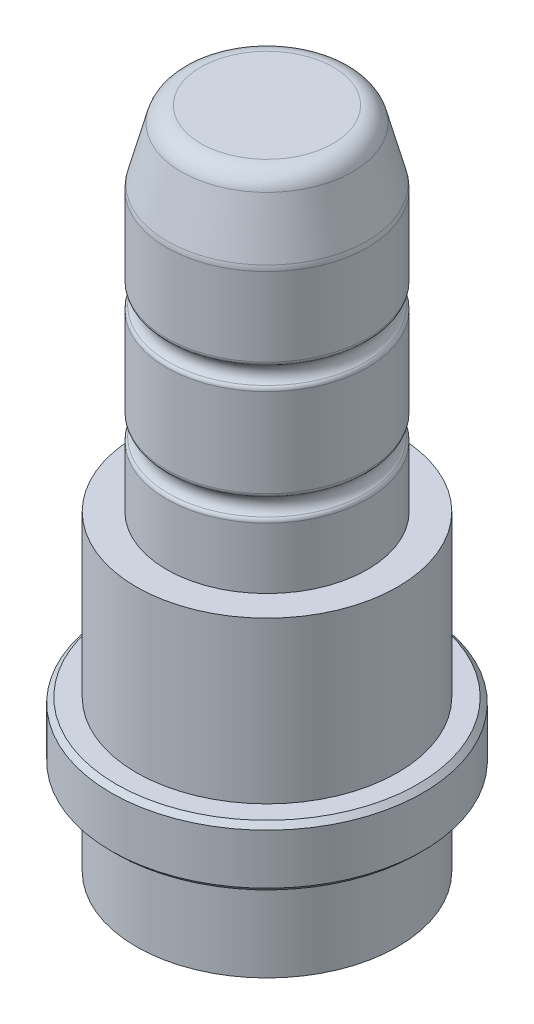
ISO-10303-21;
HEADER;
FILE_DESCRIPTION(('STEP AP214'),'2;1');
FILE_NAME('part.step','',(''),(''),'','','');
FILE_SCHEMA(('AUTOMOTIVE_DESIGN { 1 0 10303 214 1 1 1 1 }'));
ENDSEC;
DATA;
#1=APPLICATION_CONTEXT('core data for automotive mechanical design processes');
#2=APPLICATION_PROTOCOL_DEFINITION('international standard','automotive_design',2000,#1);
#3=PRODUCT_CONTEXT('',#1,'mechanical');
#4=PRODUCT('Part','Part','',(#3));
#5=PRODUCT_RELATED_PRODUCT_CATEGORY('part','',(#4));
#6=PRODUCT_DEFINITION_FORMATION('','',#4);
#7=PRODUCT_DEFINITION_CONTEXT('part definition',#1,'design');
#8=PRODUCT_DEFINITION('design','',#6,#7);
#9=PRODUCT_DEFINITION_SHAPE('','',#8);
#10=(LENGTH_UNIT() NAMED_UNIT(*) SI_UNIT(.MILLI.,.METRE.));
#11=(NAMED_UNIT(*) PLANE_ANGLE_UNIT() SI_UNIT($,.RADIAN.));
#12=(NAMED_UNIT(*) SI_UNIT($,.STERADIAN.) SOLID_ANGLE_UNIT());
#13=UNCERTAINTY_MEASURE_WITH_UNIT(LENGTH_MEASURE(1.E-05),#10,'distance_accuracy_value','');
#14=(GEOMETRIC_REPRESENTATION_CONTEXT(3) GLOBAL_UNCERTAINTY_ASSIGNED_CONTEXT((#13)) GLOBAL_UNIT_ASSIGNED_CONTEXT((#10,
#11,#12)) REPRESENTATION_CONTEXT('',''));
#15=CARTESIAN_POINT('',(0.,0.,0.));
#16=DIRECTION('',(0.,0.,1.));
#17=DIRECTION('',(1.,0.,0.));
#18=AXIS2_PLACEMENT_3D('',#15,#16,#17);
#19=CARTESIAN_POINT('',(0.,6.,0.));
#20=DIRECTION('',(0.,-1.,0.));
#21=DIRECTION('',(0.,0.,-1.));
#22=AXIS2_PLACEMENT_3D('',#19,#20,#21);
#23=CYLINDRICAL_SURFACE('',#22,15.5);
#24=CARTESIAN_POINT('',(0.,5.5,0.));
#25=DIRECTION('',(0.,1.,0.));
#26=DIRECTION('',(0.,0.,1.));
#27=AXIS2_PLACEMENT_3D('',#24,#25,#26);
#28=CIRCLE('',#27,15.5);
#29=CARTESIAN_POINT('',(0.,5.5,15.5));
#30=VERTEX_POINT('',#29);
#31=EDGE_CURVE('E22',#30,#30,#28,.F.);
#32=ORIENTED_EDGE('',*,*,#31,.T.);
#33=EDGE_LOOP('',(#32));
#34=FACE_BOUND('',#33,.T.);
#35=CARTESIAN_POINT('',(0.,0.5,0.));
#36=DIRECTION('',(0.,1.,0.));
#37=DIRECTION('',(0.,0.,1.));
#38=AXIS2_PLACEMENT_3D('',#35,#36,#37);
#39=CIRCLE('',#38,15.5);
#40=CARTESIAN_POINT('',(0.,0.5,15.5));
#41=VERTEX_POINT('',#40);
#42=EDGE_CURVE('E30',#41,#41,#39,.T.);
#43=ORIENTED_EDGE('',*,*,#42,.T.);
#44=EDGE_LOOP('',(#43));
#45=FACE_BOUND('',#44,.T.);
#46=ADVANCED_FACE('F14',(#34,#45),#23,.T.);
#47=CARTESIAN_POINT('',(0.,6.,0.));
#48=DIRECTION('',(0.,1.,0.));
#49=DIRECTION('',(0.,0.,1.));
#50=AXIS2_PLACEMENT_3D('',#47,#48,#49);
#51=PLANE('',#50);
#52=CARTESIAN_POINT('',(0.,6.,0.));
#53=DIRECTION('',(0.,1.,0.));
#54=DIRECTION('',(0.,0.,1.));
#55=AXIS2_PLACEMENT_3D('',#52,#53,#54);
#56=CIRCLE('',#55,15.);
#57=CARTESIAN_POINT('',(0.,6.,15.));
#58=VERTEX_POINT('',#57);
#59=EDGE_CURVE('E36',#58,#58,#56,.T.);
#60=ORIENTED_EDGE('',*,*,#59,.T.);
#61=EDGE_LOOP('',(#60));
#62=FACE_BOUND('',#61,.T.);
#63=CARTESIAN_POINT('',(0.,6.,0.));
#64=DIRECTION('',(0.,-1.,0.));
#65=DIRECTION('',(0.,0.,-1.));
#66=AXIS2_PLACEMENT_3D('',#63,#64,#65);
#67=CIRCLE('',#66,13.);
#68=CARTESIAN_POINT('',(0.,5.99999999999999,-13.));
#69=VERTEX_POINT('',#68);
#70=EDGE_CURVE('E47',#69,#69,#67,.T.);
#71=ORIENTED_EDGE('',*,*,#70,.T.);
#72=EDGE_LOOP('',(#71));
#73=FACE_BOUND('',#72,.T.);
#74=ADVANCED_FACE('F125',(#62,#73),#51,.T.);
#75=CARTESIAN_POINT('',(0.,0.,0.));
#76=DIRECTION('',(0.,1.,0.));
#77=DIRECTION('',(0.,0.,1.));
#78=AXIS2_PLACEMENT_3D('',#75,#76,#77);
#79=PLANE('',#78);
#80=CARTESIAN_POINT('',(0.,0.,0.));
#81=DIRECTION('',(0.,1.,0.));
#82=DIRECTION('',(0.,0.,1.));
#83=AXIS2_PLACEMENT_3D('',#80,#81,#82);
#84=CIRCLE('',#83,15.);
#85=CARTESIAN_POINT('',(0.,0.,15.));
#86=VERTEX_POINT('',#85);
#87=EDGE_CURVE('E9',#86,#86,#84,.F.);
#88=ORIENTED_EDGE('',*,*,#87,.T.);
#89=EDGE_LOOP('',(#88));
#90=FACE_BOUND('',#89,.T.);
#91=CARTESIAN_POINT('',(0.,0.,0.));
#92=DIRECTION('',(0.,1.,0.));
#93=DIRECTION('',(0.,0.,1.));
#94=AXIS2_PLACEMENT_3D('',#91,#92,#93);
#95=CIRCLE('',#94,13.);
#96=CARTESIAN_POINT('',(0.,0.,13.));
#97=VERTEX_POINT('',#96);
#98=EDGE_CURVE('E103',#97,#97,#95,.T.);
#99=ORIENTED_EDGE('',*,*,#98,.T.);
#100=EDGE_LOOP('',(#99));
#101=FACE_BOUND('',#100,.T.);
#102=ADVANCED_FACE('F108',(#90,#101),#79,.F.);
#103=CARTESIAN_POINT('',(0.,22.,0.));
#104=DIRECTION('',(0.,-1.,0.));
#105=DIRECTION('',(0.,0.,-1.));
#106=AXIS2_PLACEMENT_3D('',#103,#104,#105);
#107=PLANE('',#106);
#108=CARTESIAN_POINT('',(0.,22.,0.));
#109=DIRECTION('',(0.,1.,0.));
#110=DIRECTION('',(0.,0.,1.));
#111=AXIS2_PLACEMENT_3D('',#108,#109,#110);
#112=CIRCLE('',#111,10.);
#113=CARTESIAN_POINT('',(0.,22.,9.99999999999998));
#114=VERTEX_POINT('',#113);
#115=EDGE_CURVE('E42',#114,#114,#112,.T.);
#116=ORIENTED_EDGE('',*,*,#115,.F.);
#117=EDGE_LOOP('',(#116));
#118=FACE_BOUND('',#117,.T.);
#119=CARTESIAN_POINT('',(0.,22.,0.));
#120=DIRECTION('',(0.,-1.,0.));
#121=DIRECTION('',(0.,0.,-1.));
#122=AXIS2_PLACEMENT_3D('',#119,#120,#121);
#123=CIRCLE('',#122,13.);
#124=CARTESIAN_POINT('',(0.,22.,-13.));
#125=VERTEX_POINT('',#124);
#126=EDGE_CURVE('E43',#125,#125,#123,.T.);
#127=ORIENTED_EDGE('',*,*,#126,.F.);
#128=EDGE_LOOP('',(#127));
#129=FACE_BOUND('',#128,.T.);
#130=ADVANCED_FACE('F134',(#118,#129),#107,.F.);
#131=CARTESIAN_POINT('',(0.,6.,0.));
#132=DIRECTION('',(0.,-1.,0.));
#133=DIRECTION('',(0.,0.,-1.));
#134=AXIS2_PLACEMENT_3D('',#131,#132,#133);
#135=CYLINDRICAL_SURFACE('',#134,13.);
#136=ORIENTED_EDGE('',*,*,#70,.F.);
#137=EDGE_LOOP('',(#136));
#138=FACE_BOUND('',#137,.T.);
#139=ORIENTED_EDGE('',*,*,#126,.T.);
#140=EDGE_LOOP('',(#139));
#141=FACE_BOUND('',#140,.T.);
#142=ADVANCED_FACE('F138',(#138,#141),#135,.T.);
#143=CARTESIAN_POINT('',(0.,57.,0.));
#144=DIRECTION('',(0.,1.,0.));
#145=DIRECTION('',(0.,0.,1.));
#146=AXIS2_PLACEMENT_3D('',#143,#144,#145);
#147=PLANE('',#146);
#148=CARTESIAN_POINT('',(0.,57.,0.));
#149=DIRECTION('',(0.,1.,0.));
#150=DIRECTION('',(0.,0.,1.));
#151=AXIS2_PLACEMENT_3D('',#148,#149,#150);
#152=CIRCLE('',#151,6.58970167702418);
#153=CARTESIAN_POINT('',(0.,57.,6.58970167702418));
#154=VERTEX_POINT('',#153);
#155=EDGE_CURVE('E51',#154,#154,#152,.T.);
#156=ORIENTED_EDGE('',*,*,#155,.T.);
#157=EDGE_LOOP('',(#156));
#158=FACE_BOUND('',#157,.T.);
#159=ADVANCED_FACE('F142',(#158),#147,.T.);
#160=CARTESIAN_POINT('',(0.,55.,0.));
#161=DIRECTION('',(0.,1.,0.));
#162=DIRECTION('',(0.,0.,1.));
#163=AXIS2_PLACEMENT_3D('',#160,#161,#162);
#164=TOROIDAL_SURFACE('',#163,6.58970167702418,2.);
#165=CARTESIAN_POINT('',(0.,55.5176380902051,0.));
#166=DIRECTION('',(0.,1.,0.));
#167=DIRECTION('',(0.,0.,1.));
#168=AXIS2_PLACEMENT_3D('',#165,#166,#167);
#169=CIRCLE('',#168,8.52155332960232);
#170=CARTESIAN_POINT('',(0.,55.5176380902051,8.52155332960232));
#171=VERTEX_POINT('',#170);
#172=EDGE_CURVE('E54',#171,#171,#169,.T.);
#173=ORIENTED_EDGE('',*,*,#172,.T.);
#174=EDGE_LOOP('',(#173));
#175=FACE_BOUND('',#174,.T.);
#176=ORIENTED_EDGE('',*,*,#155,.F.);
#177=EDGE_LOOP('',(#176));
#178=FACE_BOUND('',#177,.T.);
#179=ADVANCED_FACE('F146',(#175,#178),#164,.T.);
#180=CARTESIAN_POINT('',(0.,55.5176380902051,0.));
#181=DIRECTION('',(0.,-1.,0.));
#182=DIRECTION('',(0.,0.,-1.));
#183=AXIS2_PLACEMENT_3D('',#180,#181,#182);
#184=CONICAL_SURFACE('',#183,8.52155332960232,0.261799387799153);
#185=CARTESIAN_POINT('',(0.,50.2543330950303,0.));
#186=DIRECTION('',(0.,1.,0.));
#187=DIRECTION('',(0.,0.,1.));
#188=AXIS2_PLACEMENT_3D('',#185,#186,#187);
#189=CIRCLE('',#188,9.93185165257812);
#190=CARTESIAN_POINT('',(0.,50.2543330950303,9.93185165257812));
#191=VERTEX_POINT('',#190);
#192=EDGE_CURVE('E58',#191,#191,#189,.T.);
#193=ORIENTED_EDGE('',*,*,#192,.T.);
#194=EDGE_LOOP('',(#193));
#195=FACE_BOUND('',#194,.T.);
#196=ORIENTED_EDGE('',*,*,#172,.F.);
#197=EDGE_LOOP('',(#196));
#198=FACE_BOUND('',#197,.T.);
#199=ADVANCED_FACE('F150',(#195,#198),#184,.T.);
#200=CARTESIAN_POINT('',(0.,49.7366950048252,0.));
#201=DIRECTION('',(0.,1.,0.));
#202=DIRECTION('',(0.,0.,1.));
#203=AXIS2_PLACEMENT_3D('',#200,#201,#202);
#204=TOROIDAL_SURFACE('',#203,8.,2.);
#205=CARTESIAN_POINT('',(0.,49.7366950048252,0.));
#206=DIRECTION('',(0.,1.,0.));
#207=DIRECTION('',(0.,0.,1.));
#208=AXIS2_PLACEMENT_3D('',#205,#206,#207);
#209=CIRCLE('',#208,10.);
#210=CARTESIAN_POINT('',(0.,49.7366950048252,10.));
#211=VERTEX_POINT('',#210);
#212=EDGE_CURVE('E62',#211,#211,#209,.T.);
#213=ORIENTED_EDGE('',*,*,#212,.T.);
#214=EDGE_LOOP('',(#213));
#215=FACE_BOUND('',#214,.T.);
#216=ORIENTED_EDGE('',*,*,#192,.F.);
#217=EDGE_LOOP('',(#216));
#218=FACE_BOUND('',#217,.T.);
#219=ADVANCED_FACE('F154',(#215,#218),#204,.T.);
#220=CARTESIAN_POINT('',(0.,57.,0.));
#221=DIRECTION('',(0.,1.,0.));
#222=DIRECTION('',(0.,0.,1.));
#223=AXIS2_PLACEMENT_3D('',#220,#221,#222);
#224=CYLINDRICAL_SURFACE('',#223,10.);
#225=CARTESIAN_POINT('',(0.,41.9386863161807,0.));
#226=DIRECTION('',(0.,1.,0.));
#227=DIRECTION('',(0.,0.,1.));
#228=AXIS2_PLACEMENT_3D('',#225,#226,#227);
#229=CIRCLE('',#228,10.);
#230=CARTESIAN_POINT('',(0.,41.9386863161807,9.99999999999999));
#231=VERTEX_POINT('',#230);
#232=EDGE_CURVE('E66',#231,#231,#229,.T.);
#233=ORIENTED_EDGE('',*,*,#232,.T.);
#234=EDGE_LOOP('',(#233));
#235=FACE_BOUND('',#234,.T.);
#236=ORIENTED_EDGE('',*,*,#212,.F.);
#237=EDGE_LOOP('',(#236));
#238=FACE_BOUND('',#237,.T.);
#239=ADVANCED_FACE('F158',(#235,#238),#224,.T.);
#240=CARTESIAN_POINT('',(0.,41.9386863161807,0.));
#241=DIRECTION('',(0.,1.,0.));
#242=DIRECTION('',(0.,0.,1.));
#243=AXIS2_PLACEMENT_3D('',#240,#241,#242);
#244=TOROIDAL_SURFACE('',#243,9.5,0.5);
#245=CARTESIAN_POINT('',(0.,41.545610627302,0.));
#246=DIRECTION('',(0.,1.,0.));
#247=DIRECTION('',(0.,0.,1.));
#248=AXIS2_PLACEMENT_3D('',#245,#246,#247);
#249=CIRCLE('',#248,9.80901699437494);
#250=CARTESIAN_POINT('',(0.,41.545610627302,9.80901699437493));
#251=VERTEX_POINT('',#250);
#252=EDGE_CURVE('E70',#251,#251,#249,.T.);
#253=ORIENTED_EDGE('',*,*,#252,.T.);
#254=EDGE_LOOP('',(#253));
#255=FACE_BOUND('',#254,.T.);
#256=ORIENTED_EDGE('',*,*,#232,.F.);
#257=EDGE_LOOP('',(#256));
#258=FACE_BOUND('',#257,.T.);
#259=ADVANCED_FACE('F162',(#255,#258),#244,.T.);
#260=CARTESIAN_POINT('',(0.,40.6666666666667,0.));
#261=DIRECTION('',(0.,1.,0.));
#262=DIRECTION('',(0.,0.,1.));
#263=AXIS2_PLACEMENT_3D('',#260,#261,#262);
#264=TOROIDAL_SURFACE('',#263,10.5,1.11803398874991);
#265=CARTESIAN_POINT('',(0.,39.7877227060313,0.));
#266=DIRECTION('',(0.,1.,0.));
#267=DIRECTION('',(0.,0.,1.));
#268=AXIS2_PLACEMENT_3D('',#265,#266,#267);
#269=CIRCLE('',#268,9.80901699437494);
#270=CARTESIAN_POINT('',(0.,39.7877227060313,9.80901699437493));
#271=VERTEX_POINT('',#270);
#272=EDGE_CURVE('E74',#271,#271,#269,.T.);
#273=ORIENTED_EDGE('',*,*,#272,.T.);
#274=EDGE_LOOP('',(#273));
#275=FACE_BOUND('',#274,.T.);
#276=ORIENTED_EDGE('',*,*,#252,.F.);
#277=EDGE_LOOP('',(#276));
#278=FACE_BOUND('',#277,.T.);
#279=ADVANCED_FACE('F166',(#275,#278),#264,.F.);
#280=CARTESIAN_POINT('',(0.,39.3946470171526,0.));
#281=DIRECTION('',(0.,1.,0.));
#282=DIRECTION('',(0.,0.,1.));
#283=AXIS2_PLACEMENT_3D('',#280,#281,#282);
#284=TOROIDAL_SURFACE('',#283,9.5,0.5);
#285=CARTESIAN_POINT('',(0.,39.3946470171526,0.));
#286=DIRECTION('',(0.,1.,0.));
#287=DIRECTION('',(0.,0.,1.));
#288=AXIS2_PLACEMENT_3D('',#285,#286,#287);
#289=CIRCLE('',#288,10.);
#290=CARTESIAN_POINT('',(0.,39.3946470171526,9.99999999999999));
#291=VERTEX_POINT('',#290);
#292=EDGE_CURVE('E78',#291,#291,#289,.T.);
#293=ORIENTED_EDGE('',*,*,#292,.T.);
#294=EDGE_LOOP('',(#293));
#295=FACE_BOUND('',#294,.T.);
#296=ORIENTED_EDGE('',*,*,#272,.F.);
#297=EDGE_LOOP('',(#296));
#298=FACE_BOUND('',#297,.T.);
#299=ADVANCED_FACE('F170',(#295,#298),#284,.T.);
#300=CARTESIAN_POINT('',(0.,57.,0.));
#301=DIRECTION('',(0.,1.,0.));
#302=DIRECTION('',(0.,0.,1.));
#303=AXIS2_PLACEMENT_3D('',#300,#301,#302);
#304=CYLINDRICAL_SURFACE('',#303,10.);
#305=CARTESIAN_POINT('',(0.,30.6053529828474,0.));
#306=DIRECTION('',(0.,1.,0.));
#307=DIRECTION('',(0.,0.,1.));
#308=AXIS2_PLACEMENT_3D('',#305,#306,#307);
#309=CIRCLE('',#308,10.);
#310=CARTESIAN_POINT('',(0.,30.6053529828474,9.99999999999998));
#311=VERTEX_POINT('',#310);
#312=EDGE_CURVE('E82',#311,#311,#309,.T.);
#313=ORIENTED_EDGE('',*,*,#312,.T.);
#314=EDGE_LOOP('',(#313));
#315=FACE_BOUND('',#314,.T.);
#316=ORIENTED_EDGE('',*,*,#292,.F.);
#317=EDGE_LOOP('',(#316));
#318=FACE_BOUND('',#317,.T.);
#319=ADVANCED_FACE('F174',(#315,#318),#304,.T.);
#320=CARTESIAN_POINT('',(0.,30.6053529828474,0.));
#321=DIRECTION('',(0.,1.,0.));
#322=DIRECTION('',(0.,0.,1.));
#323=AXIS2_PLACEMENT_3D('',#320,#321,#322);
#324=TOROIDAL_SURFACE('',#323,9.5,0.5);
#325=CARTESIAN_POINT('',(0.,30.2122772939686,0.));
#326=DIRECTION('',(0.,1.,0.));
#327=DIRECTION('',(0.,0.,1.));
#328=AXIS2_PLACEMENT_3D('',#325,#326,#327);
#329=CIRCLE('',#328,9.80901699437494);
#330=CARTESIAN_POINT('',(0.,30.2122772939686,9.80901699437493));
#331=VERTEX_POINT('',#330);
#332=EDGE_CURVE('E85',#331,#331,#329,.T.);
#333=ORIENTED_EDGE('',*,*,#332,.T.);
#334=EDGE_LOOP('',(#333));
#335=FACE_BOUND('',#334,.T.);
#336=ORIENTED_EDGE('',*,*,#312,.F.);
#337=EDGE_LOOP('',(#336));
#338=FACE_BOUND('',#337,.T.);
#339=ADVANCED_FACE('F178',(#335,#338),#324,.T.);
#340=CARTESIAN_POINT('',(0.,29.3333333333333,0.));
#341=DIRECTION('',(0.,1.,0.));
#342=DIRECTION('',(0.,0.,1.));
#343=AXIS2_PLACEMENT_3D('',#340,#341,#342);
#344=TOROIDAL_SURFACE('',#343,10.5,1.11803398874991);
#345=CARTESIAN_POINT('',(0.,28.4543893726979,0.));
#346=DIRECTION('',(0.,1.,0.));
#347=DIRECTION('',(0.,0.,1.));
#348=AXIS2_PLACEMENT_3D('',#345,#346,#347);
#349=CIRCLE('',#348,9.80901699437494);
#350=CARTESIAN_POINT('',(0.,28.4543893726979,9.80901699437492));
#351=VERTEX_POINT('',#350);
#352=EDGE_CURVE('E89',#351,#351,#349,.T.);
#353=ORIENTED_EDGE('',*,*,#352,.T.);
#354=EDGE_LOOP('',(#353));
#355=FACE_BOUND('',#354,.T.);
#356=ORIENTED_EDGE('',*,*,#332,.F.);
#357=EDGE_LOOP('',(#356));
#358=FACE_BOUND('',#357,.T.);
#359=ADVANCED_FACE('F182',(#355,#358),#344,.F.);
#360=CARTESIAN_POINT('',(0.,28.0613136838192,0.));
#361=DIRECTION('',(0.,1.,0.));
#362=DIRECTION('',(0.,0.,1.));
#363=AXIS2_PLACEMENT_3D('',#360,#361,#362);
#364=TOROIDAL_SURFACE('',#363,9.5,0.5);
#365=CARTESIAN_POINT('',(0.,28.0613136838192,0.));
#366=DIRECTION('',(0.,1.,0.));
#367=DIRECTION('',(0.,0.,1.));
#368=AXIS2_PLACEMENT_3D('',#365,#366,#367);
#369=CIRCLE('',#368,10.);
#370=CARTESIAN_POINT('',(0.,28.0613136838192,9.99999999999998));
#371=VERTEX_POINT('',#370);
#372=EDGE_CURVE('E92',#371,#371,#369,.T.);
#373=ORIENTED_EDGE('',*,*,#372,.T.);
#374=EDGE_LOOP('',(#373));
#375=FACE_BOUND('',#374,.T.);
#376=ORIENTED_EDGE('',*,*,#352,.F.);
#377=EDGE_LOOP('',(#376));
#378=FACE_BOUND('',#377,.T.);
#379=ADVANCED_FACE('F186',(#375,#378),#364,.T.);
#380=CARTESIAN_POINT('',(0.,57.,0.));
#381=DIRECTION('',(0.,1.,0.));
#382=DIRECTION('',(0.,0.,1.));
#383=AXIS2_PLACEMENT_3D('',#380,#381,#382);
#384=CYLINDRICAL_SURFACE('',#383,10.);
#385=ORIENTED_EDGE('',*,*,#115,.T.);
#386=EDGE_LOOP('',(#385));
#387=FACE_BOUND('',#386,.T.);
#388=ORIENTED_EDGE('',*,*,#372,.F.);
#389=EDGE_LOOP('',(#388));
#390=FACE_BOUND('',#389,.T.);
#391=ADVANCED_FACE('F121',(#387,#390),#384,.T.);
#392=CARTESIAN_POINT('',(0.,-9.,0.));
#393=DIRECTION('',(0.,-1.,0.));
#394=DIRECTION('',(0.,0.,-1.));
#395=AXIS2_PLACEMENT_3D('',#392,#393,#394);
#396=PLANE('',#395);
#397=CARTESIAN_POINT('',(0.,-9.,0.));
#398=DIRECTION('',(0.,1.,0.));
#399=DIRECTION('',(0.,0.,1.));
#400=AXIS2_PLACEMENT_3D('',#397,#398,#399);
#401=CIRCLE('',#400,13.);
#402=CARTESIAN_POINT('',(0.,-9.,13.));
#403=VERTEX_POINT('',#402);
#404=EDGE_CURVE('E96',#403,#403,#401,.T.);
#405=ORIENTED_EDGE('',*,*,#404,.F.);
#406=EDGE_LOOP('',(#405));
#407=FACE_BOUND('',#406,.T.);
#408=ADVANCED_FACE('F113',(#407),#396,.T.);
#409=CARTESIAN_POINT('',(0.,0.,0.));
#410=DIRECTION('',(0.,1.,0.));
#411=DIRECTION('',(0.,0.,1.));
#412=AXIS2_PLACEMENT_3D('',#409,#410,#411);
#413=CYLINDRICAL_SURFACE('',#412,13.);
#414=ORIENTED_EDGE('',*,*,#404,.T.);
#415=EDGE_LOOP('',(#414));
#416=FACE_BOUND('',#415,.T.);
#417=ORIENTED_EDGE('',*,*,#98,.F.);
#418=EDGE_LOOP('',(#417));
#419=FACE_BOUND('',#418,.T.);
#420=ADVANCED_FACE('F110',(#416,#419),#413,.T.);
#421=CARTESIAN_POINT('',(0.,6.,0.));
#422=DIRECTION('',(0.,-1.,0.));
#423=DIRECTION('',(0.,0.,-1.));
#424=AXIS2_PLACEMENT_3D('',#421,#422,#423);
#425=CONICAL_SURFACE('',#424,15.,0.78539816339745);
#426=ORIENTED_EDGE('',*,*,#31,.F.);
#427=EDGE_LOOP('',(#426));
#428=FACE_BOUND('',#427,.T.);
#429=ORIENTED_EDGE('',*,*,#59,.F.);
#430=EDGE_LOOP('',(#429));
#431=FACE_BOUND('',#430,.T.);
#432=ADVANCED_FACE('F112',(#428,#431),#425,.T.);
#433=CARTESIAN_POINT('',(0.,0.5,0.));
#434=DIRECTION('',(0.,1.,0.));
#435=DIRECTION('',(0.,0.,1.));
#436=AXIS2_PLACEMENT_3D('',#433,#434,#435);
#437=CONICAL_SURFACE('',#436,15.5,0.785398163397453);
#438=ORIENTED_EDGE('',*,*,#87,.F.);
#439=EDGE_LOOP('',(#438));
#440=FACE_BOUND('',#439,.T.);
#441=ORIENTED_EDGE('',*,*,#42,.F.);
#442=EDGE_LOOP('',(#441));
#443=FACE_BOUND('',#442,.T.);
#444=ADVANCED_FACE('F16',(#440,#443),#437,.T.);
#445=CLOSED_SHELL('',(#46,#74,#102,#130,#142,#159,#179,#199,#219,#239,#259,#279,#299,#319,#339,
#359,#379,#391,#408,#420,#432,#444));
#446=MANIFOLD_SOLID_BREP('B1',#445);
#447=ADVANCED_BREP_SHAPE_REPRESENTATION('',(#18,#446),#14);
#448=SHAPE_DEFINITION_REPRESENTATION(#9,#447);
ENDSEC;
END-ISO-10303-21;
